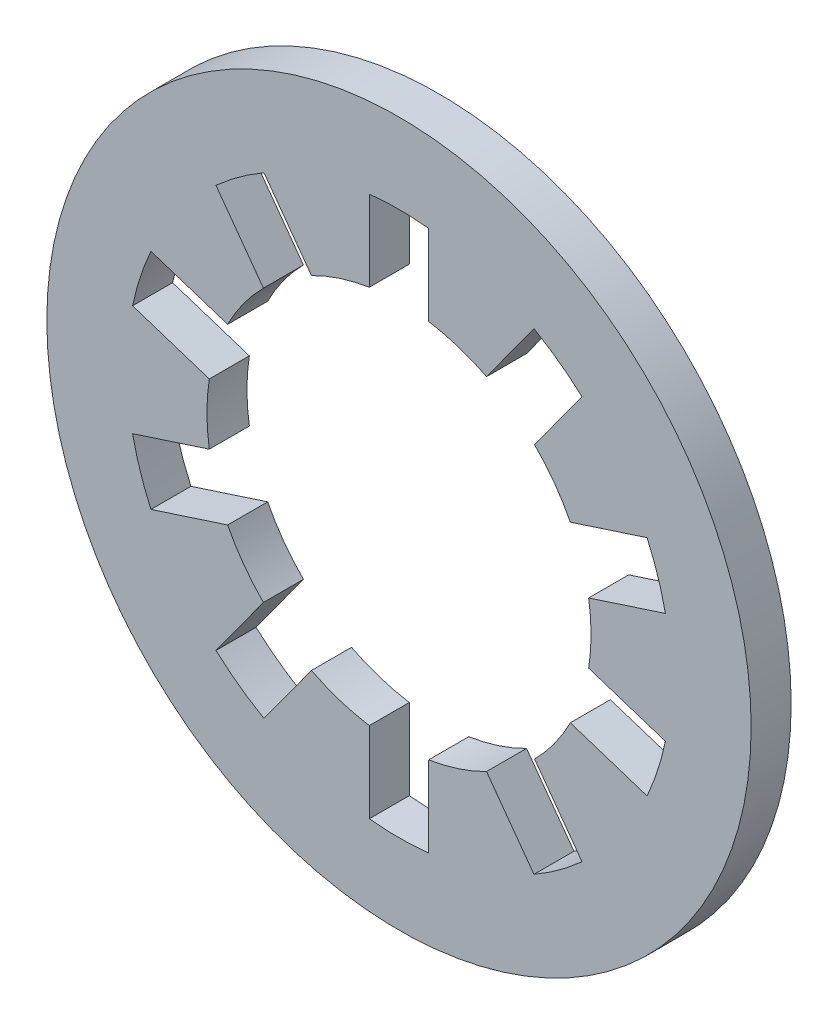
from build123d import *

# Parameters (mm, degrees)
SKETCH1_R          = 2.2
SKETCH1_R_2        = 1.2
EXTRUDE1_DEPTH     = 0.25
CUT_EXTRUDE1_DEPTH = 4.121297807
CIRPATTERN1_COUNT  = 10


with BuildPart() as part:
    # Sketch1 → Extrude1 (new body)
    with BuildSketch(Plane.XY):
        Circle(SKETCH1_R)
        Circle(SKETCH1_R_2, mode=Mode.SUBTRACT)
    extrude(amount=EXTRUDE1_DEPTH)

    # Sketch2 → Cut-Extrude1 (cut, through all)
    with BuildSketch(Plane.XY):
        with BuildLine():
            Line((-0.185410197, 1.689858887), (-0.185410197, 1.185589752))
            Line((-0.185410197, 1.185589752), (0.185410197, 1.185589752))
            Line((0.185410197, 1.185589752), (0.185410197, 1.689858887))
            ThreePointArc((0.185410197, 1.689858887), (0, 1.7), (-0.185410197, 1.689858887))
        make_face()
    cut_extrude1 = extrude(amount=CUT_EXTRUDE1_DEPTH, mode=Mode.SUBTRACT)

    # CirPattern1: Cut-Extrude1 ×10 about axis
    cirpattern1_axis = Axis((0, 0, 0), (0, 0, 1))
    for i in range(1, CIRPATTERN1_COUNT):
        add(cut_extrude1.rotate(cirpattern1_axis, i * 360 / CIRPATTERN1_COUNT), mode=Mode.SUBTRACT)


solid = part.part
